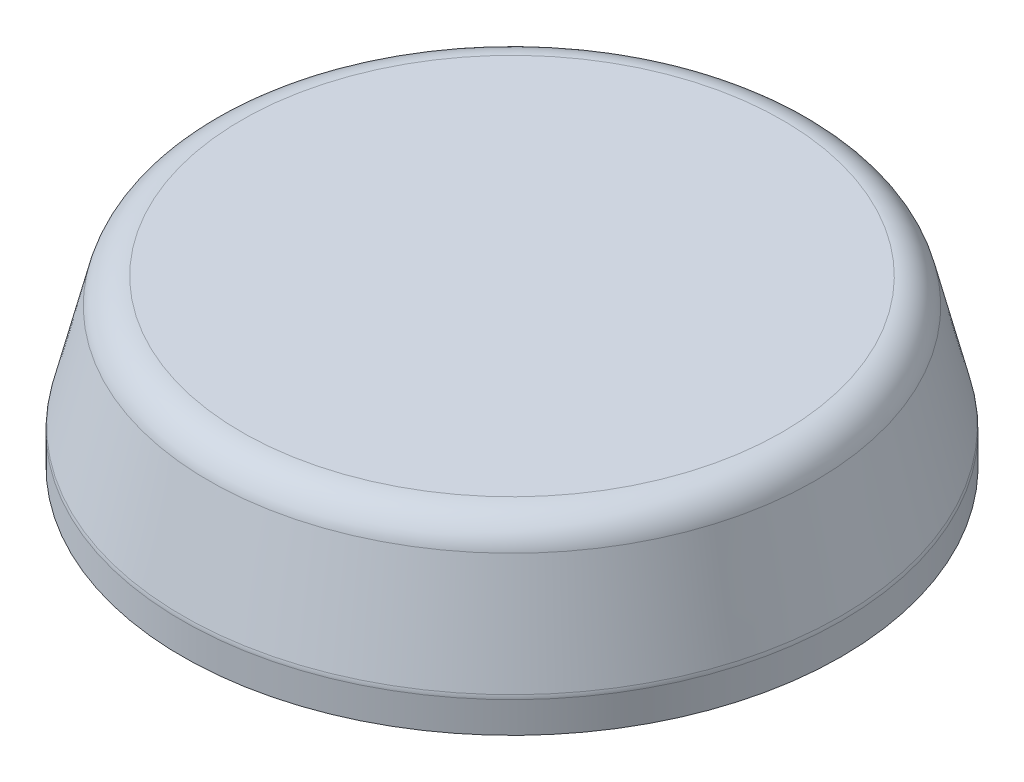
ISO-10303-21;
HEADER;
FILE_DESCRIPTION(('STEP AP214'),'2;1');
FILE_NAME('part.step','',(''),(''),'','','');
FILE_SCHEMA(('AUTOMOTIVE_DESIGN { 1 0 10303 214 1 1 1 1 }'));
ENDSEC;
DATA;
#1=APPLICATION_CONTEXT('core data for automotive mechanical design processes');
#2=APPLICATION_PROTOCOL_DEFINITION('international standard','automotive_design',2000,#1);
#3=PRODUCT_CONTEXT('',#1,'mechanical');
#4=PRODUCT('Part','Part','',(#3));
#5=PRODUCT_RELATED_PRODUCT_CATEGORY('part','',(#4));
#6=PRODUCT_DEFINITION_FORMATION('','',#4);
#7=PRODUCT_DEFINITION_CONTEXT('part definition',#1,'design');
#8=PRODUCT_DEFINITION('design','',#6,#7);
#9=PRODUCT_DEFINITION_SHAPE('','',#8);
#10=(LENGTH_UNIT() NAMED_UNIT(*) SI_UNIT(.MILLI.,.METRE.));
#11=(NAMED_UNIT(*) PLANE_ANGLE_UNIT() SI_UNIT($,.RADIAN.));
#12=(NAMED_UNIT(*) SI_UNIT($,.STERADIAN.) SOLID_ANGLE_UNIT());
#13=UNCERTAINTY_MEASURE_WITH_UNIT(LENGTH_MEASURE(1.E-05),#10,'distance_accuracy_value','');
#14=(GEOMETRIC_REPRESENTATION_CONTEXT(3) GLOBAL_UNCERTAINTY_ASSIGNED_CONTEXT((#13)) GLOBAL_UNIT_ASSIGNED_CONTEXT((#10,
#11,#12)) REPRESENTATION_CONTEXT('',''));
#15=CARTESIAN_POINT('',(0.,0.,0.));
#16=DIRECTION('',(0.,0.,1.));
#17=DIRECTION('',(1.,0.,0.));
#18=AXIS2_PLACEMENT_3D('',#15,#16,#17);
#19=CARTESIAN_POINT('',(0.,0.,0.));
#20=DIRECTION('',(0.,-1.,0.));
#21=DIRECTION('',(1.,0.,0.));
#22=AXIS2_PLACEMENT_3D('',#19,#20,#21);
#23=CYLINDRICAL_SURFACE('',#22,121.92);
#24=CARTESIAN_POINT('',(0.,11.9231173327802,0.));
#25=DIRECTION('',(0.,-1.,0.));
#26=DIRECTION('',(1.,0.,0.));
#27=AXIS2_PLACEMENT_3D('',#24,#25,#26);
#28=CIRCLE('',#27,121.92);
#29=CARTESIAN_POINT('',(121.92,11.9231173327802,0.));
#30=VERTEX_POINT('',#29);
#31=EDGE_CURVE('E65',#30,#30,#28,.T.);
#32=ORIENTED_EDGE('',*,*,#31,.F.);
#33=EDGE_LOOP('',(#32));
#34=FACE_BOUND('',#33,.T.);
#35=CARTESIAN_POINT('',(0.,0.,0.));
#36=DIRECTION('',(0.,-1.,0.));
#37=DIRECTION('',(1.,0.,0.));
#38=AXIS2_PLACEMENT_3D('',#35,#36,#37);
#39=CIRCLE('',#38,121.92);
#40=CARTESIAN_POINT('',(121.92,0.,0.));
#41=VERTEX_POINT('',#40);
#42=EDGE_CURVE('E10',#41,#41,#39,.T.);
#43=ORIENTED_EDGE('',*,*,#42,.T.);
#44=EDGE_LOOP('',(#43));
#45=FACE_BOUND('',#44,.T.);
#46=ADVANCED_FACE('F31',(#34,#45),#23,.F.);
#47=CARTESIAN_POINT('',(-121.92,0.,0.));
#48=DIRECTION('',(0.,1.,0.));
#49=DIRECTION('',(-1.,0.,0.));
#50=AXIS2_PLACEMENT_3D('',#47,#48,#49);
#51=PLANE('',#50);
#52=ORIENTED_EDGE('',*,*,#42,.F.);
#53=EDGE_LOOP('',(#52));
#54=FACE_BOUND('',#53,.T.);
#55=CARTESIAN_POINT('',(0.,0.,0.));
#56=DIRECTION('',(0.,-1.,0.));
#57=DIRECTION('',(1.,0.,0.));
#58=AXIS2_PLACEMENT_3D('',#55,#56,#57);
#59=CIRCLE('',#58,127.);
#60=CARTESIAN_POINT('',(127.,0.,0.));
#61=VERTEX_POINT('',#60);
#62=EDGE_CURVE('E37',#61,#61,#59,.T.);
#63=ORIENTED_EDGE('',*,*,#62,.T.);
#64=EDGE_LOOP('',(#63));
#65=FACE_BOUND('',#64,.T.);
#66=ADVANCED_FACE('F72',(#54,#65),#51,.F.);
#67=CARTESIAN_POINT('',(0.,0.,0.));
#68=DIRECTION('',(0.,-1.,0.));
#69=DIRECTION('',(1.,0.,0.));
#70=AXIS2_PLACEMENT_3D('',#67,#68,#69);
#71=CYLINDRICAL_SURFACE('',#70,127.);
#72=ORIENTED_EDGE('',*,*,#62,.F.);
#73=EDGE_LOOP('',(#72));
#74=FACE_BOUND('',#73,.T.);
#75=CARTESIAN_POINT('',(0.,11.9231173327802,0.));
#76=DIRECTION('',(0.,-1.,0.));
#77=DIRECTION('',(1.,0.,0.));
#78=AXIS2_PLACEMENT_3D('',#75,#76,#77);
#79=CIRCLE('',#78,127.);
#80=CARTESIAN_POINT('',(127.,11.9231173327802,0.));
#81=VERTEX_POINT('',#80);
#82=EDGE_CURVE('E41',#81,#81,#79,.T.);
#83=ORIENTED_EDGE('',*,*,#82,.T.);
#84=EDGE_LOOP('',(#83));
#85=FACE_BOUND('',#84,.T.);
#86=ADVANCED_FACE('F76',(#74,#85),#71,.T.);
#87=CARTESIAN_POINT('',(0.,11.9231173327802,0.));
#88=DIRECTION('',(0.,-1.,0.));
#89=DIRECTION('',(1.,0.,0.));
#90=AXIS2_PLACEMENT_3D('',#87,#88,#89);
#91=TOROIDAL_SURFACE('',#90,120.65,6.34999999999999);
#92=ORIENTED_EDGE('',*,*,#82,.F.);
#93=EDGE_LOOP('',(#92));
#94=FACE_BOUND('',#93,.T.);
#95=CARTESIAN_POINT('',(0.,13.4539688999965,0.));
#96=DIRECTION('',(0.,-1.,0.));
#97=DIRECTION('',(1.,0.,0.));
#98=AXIS2_PLACEMENT_3D('',#95,#96,#97);
#99=CIRCLE('',#98,126.812709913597);
#100=CARTESIAN_POINT('',(126.812709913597,13.4539688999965,0.));
#101=VERTEX_POINT('',#100);
#102=EDGE_CURVE('E45',#101,#101,#99,.T.);
#103=ORIENTED_EDGE('',*,*,#102,.T.);
#104=EDGE_LOOP('',(#103));
#105=FACE_BOUND('',#104,.T.);
#106=ADVANCED_FACE('F81',(#94,#105),#91,.T.);
#107=CARTESIAN_POINT('',(0.,53.6008515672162,0.));
#108=DIRECTION('',(0.,-1.,0.));
#109=DIRECTION('',(1.,0.,0.));
#110=AXIS2_PLACEMENT_3D('',#107,#108,#109);
#111=CONICAL_SURFACE('',#110,116.84,0.243477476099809);
#112=ORIENTED_EDGE('',*,*,#102,.F.);
#113=EDGE_LOOP('',(#112));
#114=FACE_BOUND('',#113,.T.);
#115=CARTESIAN_POINT('',(0.,53.6008515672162,0.));
#116=DIRECTION('',(0.,-1.,0.));
#117=DIRECTION('',(1.,0.,0.));
#118=AXIS2_PLACEMENT_3D('',#115,#116,#117);
#119=CIRCLE('',#118,116.84);
#120=CARTESIAN_POINT('',(116.84,53.6008515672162,0.));
#121=VERTEX_POINT('',#120);
#122=EDGE_CURVE('E50',#121,#121,#119,.T.);
#123=ORIENTED_EDGE('',*,*,#122,.T.);
#124=EDGE_LOOP('',(#123));
#125=FACE_BOUND('',#124,.T.);
#126=ADVANCED_FACE('F87',(#114,#125),#111,.T.);
#127=CARTESIAN_POINT('',(0.,50.4562862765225,0.));
#128=DIRECTION('',(0.,-1.,0.));
#129=DIRECTION('',(1.,0.,0.));
#130=AXIS2_PLACEMENT_3D('',#127,#128,#129);
#131=TOROIDAL_SURFACE('',#130,104.181004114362,13.0437137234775);
#132=ORIENTED_EDGE('',*,*,#122,.F.);
#133=EDGE_LOOP('',(#132));
#134=FACE_BOUND('',#133,.T.);
#135=CARTESIAN_POINT('',(0.,63.5,0.));
#136=DIRECTION('',(0.,-1.,0.));
#137=DIRECTION('',(1.,0.,0.));
#138=AXIS2_PLACEMENT_3D('',#135,#136,#137);
#139=CIRCLE('',#138,104.181004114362);
#140=CARTESIAN_POINT('',(104.181004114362,63.5,0.));
#141=VERTEX_POINT('',#140);
#142=EDGE_CURVE('E53',#141,#141,#139,.T.);
#143=ORIENTED_EDGE('',*,*,#142,.T.);
#144=EDGE_LOOP('',(#143));
#145=FACE_BOUND('',#144,.T.);
#146=ADVANCED_FACE('F91',(#134,#145),#131,.T.);
#147=CARTESIAN_POINT('',(-104.181004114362,63.5,0.));
#148=DIRECTION('',(0.,-1.,0.));
#149=DIRECTION('',(1.,0.,0.));
#150=AXIS2_PLACEMENT_3D('',#147,#148,#149);
#151=PLANE('',#150);
#152=ORIENTED_EDGE('',*,*,#142,.F.);
#153=EDGE_LOOP('',(#152));
#154=FACE_BOUND('',#153,.T.);
#155=ADVANCED_FACE('F95',(#154),#151,.F.);
#156=CARTESIAN_POINT('',(-105.597290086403,58.42,0.));
#157=DIRECTION('',(0.,1.,0.));
#158=DIRECTION('',(-1.,0.,0.));
#159=AXIS2_PLACEMENT_3D('',#156,#157,#158);
#160=PLANE('',#159);
#161=CARTESIAN_POINT('',(0.,58.42,0.));
#162=DIRECTION('',(0.,-1.,0.));
#163=DIRECTION('',(1.,0.,0.));
#164=AXIS2_PLACEMENT_3D('',#161,#162,#163);
#165=CIRCLE('',#164,105.597290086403);
#166=CARTESIAN_POINT('',(105.597290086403,58.42,0.));
#167=VERTEX_POINT('',#166);
#168=EDGE_CURVE('E56',#167,#167,#165,.T.);
#169=ORIENTED_EDGE('',*,*,#168,.T.);
#170=EDGE_LOOP('',(#169));
#171=FACE_BOUND('',#170,.T.);
#172=ADVANCED_FACE('F99',(#171),#160,.F.);
#173=CARTESIAN_POINT('',(0.,52.07,0.));
#174=DIRECTION('',(0.,-1.,0.));
#175=DIRECTION('',(1.,0.,0.));
#176=AXIS2_PLACEMENT_3D('',#173,#174,#175);
#177=TOROIDAL_SURFACE('',#176,105.597290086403,6.35);
#178=ORIENTED_EDGE('',*,*,#168,.F.);
#179=EDGE_LOOP('',(#178));
#180=FACE_BOUND('',#179,.T.);
#181=CARTESIAN_POINT('',(0.,53.6008515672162,0.));
#182=DIRECTION('',(0.,-1.,0.));
#183=DIRECTION('',(1.,0.,0.));
#184=AXIS2_PLACEMENT_3D('',#181,#182,#183);
#185=CIRCLE('',#184,111.76);
#186=CARTESIAN_POINT('',(111.76,53.6008515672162,0.));
#187=VERTEX_POINT('',#186);
#188=EDGE_CURVE('E59',#187,#187,#185,.T.);
#189=ORIENTED_EDGE('',*,*,#188,.T.);
#190=EDGE_LOOP('',(#189));
#191=FACE_BOUND('',#190,.T.);
#192=ADVANCED_FACE('F103',(#180,#191),#177,.F.);
#193=CARTESIAN_POINT('',(0.,13.4539688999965,0.));
#194=DIRECTION('',(0.,-1.,0.));
#195=DIRECTION('',(1.,0.,0.));
#196=AXIS2_PLACEMENT_3D('',#193,#194,#195);
#197=CONICAL_SURFACE('',#196,121.732709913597,0.24347747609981);
#198=ORIENTED_EDGE('',*,*,#188,.F.);
#199=EDGE_LOOP('',(#198));
#200=FACE_BOUND('',#199,.T.);
#201=CARTESIAN_POINT('',(0.,13.4539688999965,0.));
#202=DIRECTION('',(0.,-1.,0.));
#203=DIRECTION('',(1.,0.,0.));
#204=AXIS2_PLACEMENT_3D('',#201,#202,#203);
#205=CIRCLE('',#204,121.732709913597);
#206=CARTESIAN_POINT('',(121.732709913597,13.4539688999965,0.));
#207=VERTEX_POINT('',#206);
#208=EDGE_CURVE('E62',#207,#207,#205,.T.);
#209=ORIENTED_EDGE('',*,*,#208,.T.);
#210=EDGE_LOOP('',(#209));
#211=FACE_BOUND('',#210,.T.);
#212=ADVANCED_FACE('F107',(#200,#211),#197,.F.);
#213=CARTESIAN_POINT('',(0.,11.9231173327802,0.));
#214=DIRECTION('',(0.,-1.,0.));
#215=DIRECTION('',(1.,0.,0.));
#216=AXIS2_PLACEMENT_3D('',#213,#214,#215);
#217=TOROIDAL_SURFACE('',#216,115.57,6.35);
#218=ORIENTED_EDGE('',*,*,#208,.F.);
#219=EDGE_LOOP('',(#218));
#220=FACE_BOUND('',#219,.T.);
#221=ORIENTED_EDGE('',*,*,#31,.T.);
#222=EDGE_LOOP('',(#221));
#223=FACE_BOUND('',#222,.T.);
#224=ADVANCED_FACE('F69',(#220,#223),#217,.F.);
#225=CLOSED_SHELL('',(#46,#66,#86,#106,#126,#146,#155,#172,#192,#212,#224));
#226=MANIFOLD_SOLID_BREP('B2',#225);
#227=ADVANCED_BREP_SHAPE_REPRESENTATION('',(#18,#226),#14);
#228=SHAPE_DEFINITION_REPRESENTATION(#9,#227);
ENDSEC;
END-ISO-10303-21;
